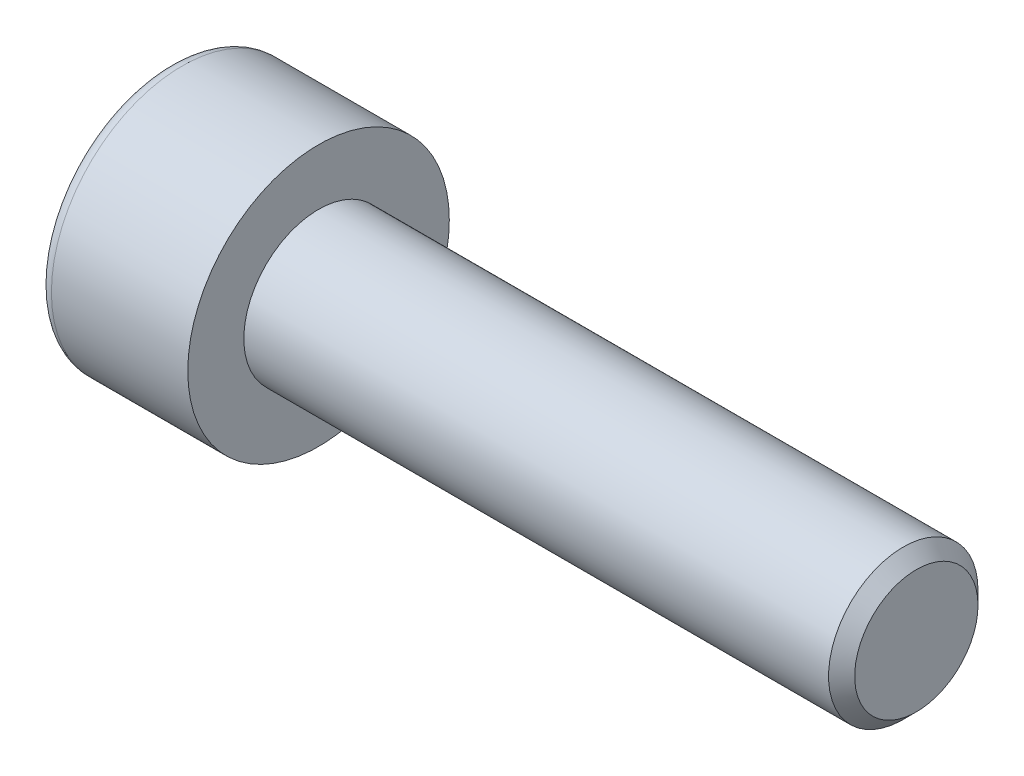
ISO-10303-21;
HEADER;
FILE_DESCRIPTION(('STEP AP214'),'2;1');
FILE_NAME('part.step','',(''),(''),'','','');
FILE_SCHEMA(('AUTOMOTIVE_DESIGN { 1 0 10303 214 1 1 1 1 }'));
ENDSEC;
DATA;
#1=APPLICATION_CONTEXT('core data for automotive mechanical design processes');
#2=APPLICATION_PROTOCOL_DEFINITION('international standard','automotive_design',2000,#1);
#3=PRODUCT_CONTEXT('',#1,'mechanical');
#4=PRODUCT('Part','Part','',(#3));
#5=PRODUCT_RELATED_PRODUCT_CATEGORY('part','',(#4));
#6=PRODUCT_DEFINITION_FORMATION('','',#4);
#7=PRODUCT_DEFINITION_CONTEXT('part definition',#1,'design');
#8=PRODUCT_DEFINITION('design','',#6,#7);
#9=PRODUCT_DEFINITION_SHAPE('','',#8);
#10=(LENGTH_UNIT() NAMED_UNIT(*) SI_UNIT(.MILLI.,.METRE.));
#11=(NAMED_UNIT(*) PLANE_ANGLE_UNIT() SI_UNIT($,.RADIAN.));
#12=(NAMED_UNIT(*) SI_UNIT($,.STERADIAN.) SOLID_ANGLE_UNIT());
#13=UNCERTAINTY_MEASURE_WITH_UNIT(LENGTH_MEASURE(1.E-05),#10,'distance_accuracy_value','');
#14=(GEOMETRIC_REPRESENTATION_CONTEXT(3) GLOBAL_UNCERTAINTY_ASSIGNED_CONTEXT((#13)) GLOBAL_UNIT_ASSIGNED_CONTEXT((#10,
#11,#12)) REPRESENTATION_CONTEXT('',''));
#15=CARTESIAN_POINT('',(0.,0.,0.));
#16=DIRECTION('',(0.,0.,1.));
#17=DIRECTION('',(1.,0.,0.));
#18=AXIS2_PLACEMENT_3D('',#15,#16,#17);
#19=CARTESIAN_POINT('',(12.5013072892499,0.,0.));
#20=DIRECTION('',(1.,0.,0.));
#21=DIRECTION('',(0.,0.,-1.));
#22=AXIS2_PLACEMENT_3D('',#19,#20,#21);
#23=CYLINDRICAL_SURFACE('',#22,2.);
#24=CARTESIAN_POINT('',(15.65,0.,0.));
#25=DIRECTION('',(1.,0.,0.));
#26=DIRECTION('',(0.,0.,-1.));
#27=AXIS2_PLACEMENT_3D('',#24,#25,#26);
#28=CIRCLE('',#27,2.);
#29=CARTESIAN_POINT('',(15.65,0.,-2.));
#30=VERTEX_POINT('',#29);
#31=EDGE_CURVE('E151',#30,#30,#28,.F.);
#32=ORIENTED_EDGE('',*,*,#31,.T.);
#33=EDGE_LOOP('',(#32));
#34=FACE_BOUND('',#33,.T.);
#35=CARTESIAN_POINT('',(0.,0.,0.));
#36=DIRECTION('',(1.,0.,0.));
#37=DIRECTION('',(0.,0.,-1.));
#38=AXIS2_PLACEMENT_3D('',#35,#36,#37);
#39=CIRCLE('',#38,2.);
#40=CARTESIAN_POINT('',(0.,0.,-2.));
#41=VERTEX_POINT('',#40);
#42=EDGE_CURVE('E137',#41,#41,#39,.T.);
#43=ORIENTED_EDGE('',*,*,#42,.T.);
#44=EDGE_LOOP('',(#43));
#45=FACE_BOUND('',#44,.T.);
#46=ADVANCED_FACE('F35',(#34,#45),#23,.T.);
#47=CARTESIAN_POINT('',(16.,2.,0.));
#48=DIRECTION('',(1.,0.,0.));
#49=DIRECTION('',(0.,0.,-1.));
#50=AXIS2_PLACEMENT_3D('',#47,#48,#49);
#51=PLANE('',#50);
#52=CARTESIAN_POINT('',(16.,0.,0.));
#53=DIRECTION('',(1.,0.,0.));
#54=DIRECTION('',(0.,0.,-1.));
#55=AXIS2_PLACEMENT_3D('',#52,#53,#54);
#56=CIRCLE('',#55,1.65);
#57=CARTESIAN_POINT('',(16.,0.,-1.65));
#58=VERTEX_POINT('',#57);
#59=EDGE_CURVE('E148',#58,#58,#56,.T.);
#60=ORIENTED_EDGE('',*,*,#59,.T.);
#61=EDGE_LOOP('',(#60));
#62=FACE_BOUND('',#61,.T.);
#63=ADVANCED_FACE('F173',(#62),#51,.T.);
#64=CARTESIAN_POINT('',(-4.00000000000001,3.49999999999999,0.));
#65=DIRECTION('',(-1.,0.,0.));
#66=DIRECTION('',(0.,0.,1.));
#67=AXIS2_PLACEMENT_3D('',#64,#65,#66);
#68=PLANE('',#67);
#69=DIRECTION('',(0.,0.866025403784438,0.5));
#70=VECTOR('',#69,1.);
#71=CARTESIAN_POINT('',(-4.00000000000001,-1.5,0.866025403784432));
#72=LINE('',#71,#70);
#73=CARTESIAN_POINT('',(-4.00000000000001,-1.5,0.866025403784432));
#74=VERTEX_POINT('',#73);
#75=CARTESIAN_POINT('',(-4.00000000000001,0.,1.73205080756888));
#76=VERTEX_POINT('',#75);
#77=EDGE_CURVE('E50',#74,#76,#72,.T.);
#78=ORIENTED_EDGE('',*,*,#77,.F.);
#79=DIRECTION('',(0.,0.,1.));
#80=VECTOR('',#79,1.);
#81=CARTESIAN_POINT('',(-4.00000000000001,-1.5,-0.866025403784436));
#82=LINE('',#81,#80);
#83=CARTESIAN_POINT('',(-4.00000000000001,-1.5,-0.866025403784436));
#84=VERTEX_POINT('',#83);
#85=EDGE_CURVE('E133',#84,#74,#82,.T.);
#86=ORIENTED_EDGE('',*,*,#85,.F.);
#87=DIRECTION('',(0.,-0.866025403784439,0.5));
#88=VECTOR('',#87,1.);
#89=CARTESIAN_POINT('',(-4.00000000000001,0.,-1.73205080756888));
#90=LINE('',#89,#88);
#91=CARTESIAN_POINT('',(-4.00000000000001,0.,-1.73205080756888));
#92=VERTEX_POINT('',#91);
#93=EDGE_CURVE('E131',#92,#84,#90,.T.);
#94=ORIENTED_EDGE('',*,*,#93,.F.);
#95=DIRECTION('',(0.,-0.866025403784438,-0.5));
#96=VECTOR('',#95,1.);
#97=CARTESIAN_POINT('',(-4.00000000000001,1.5,-0.866025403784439));
#98=LINE('',#97,#96);
#99=CARTESIAN_POINT('',(-4.00000000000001,1.5,-0.866025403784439));
#100=VERTEX_POINT('',#99);
#101=EDGE_CURVE('E98',#100,#92,#98,.T.);
#102=ORIENTED_EDGE('',*,*,#101,.F.);
#103=DIRECTION('',(0.,0.,-1.));
#104=VECTOR('',#103,1.);
#105=CARTESIAN_POINT('',(-4.,1.5,0.866025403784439));
#106=LINE('',#105,#104);
#107=CARTESIAN_POINT('',(-4.,1.5,0.866025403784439));
#108=VERTEX_POINT('',#107);
#109=EDGE_CURVE('E127',#108,#100,#106,.T.);
#110=ORIENTED_EDGE('',*,*,#109,.F.);
#111=DIRECTION('',(0.,0.866025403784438,-0.5));
#112=VECTOR('',#111,1.);
#113=CARTESIAN_POINT('',(-4.00000000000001,0.,1.73205080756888));
#114=LINE('',#113,#112);
#115=EDGE_CURVE('E124',#76,#108,#114,.T.);
#116=ORIENTED_EDGE('',*,*,#115,.F.);
#117=EDGE_LOOP('',(#78,#86,#94,#102,#110,#116));
#118=FACE_BOUND('',#117,.T.);
#119=CARTESIAN_POINT('',(-4.,0.,0.));
#120=DIRECTION('',(-1.,0.,0.));
#121=DIRECTION('',(0.,0.,1.));
#122=AXIS2_PLACEMENT_3D('',#119,#120,#121);
#123=CIRCLE('',#122,3.15);
#124=CARTESIAN_POINT('',(-4.,0.,3.15));
#125=VERTEX_POINT('',#124);
#126=EDGE_CURVE('E11',#125,#125,#123,.T.);
#127=ORIENTED_EDGE('',*,*,#126,.T.);
#128=EDGE_LOOP('',(#127));
#129=FACE_BOUND('',#128,.T.);
#130=ADVANCED_FACE('F179',(#118,#129),#68,.T.);
#131=CARTESIAN_POINT('',(12.5013072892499,0.,0.));
#132=DIRECTION('',(1.,0.,0.));
#133=DIRECTION('',(0.,0.,-1.));
#134=AXIS2_PLACEMENT_3D('',#131,#132,#133);
#135=CYLINDRICAL_SURFACE('',#134,3.5);
#136=CARTESIAN_POINT('',(-3.65000000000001,0.,0.));
#137=DIRECTION('',(-1.,0.,0.));
#138=DIRECTION('',(0.,0.,1.));
#139=AXIS2_PLACEMENT_3D('',#136,#137,#138);
#140=CIRCLE('',#139,3.5);
#141=CARTESIAN_POINT('',(-3.65000000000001,0.,3.5));
#142=VERTEX_POINT('',#141);
#143=EDGE_CURVE('E43',#142,#142,#140,.F.);
#144=ORIENTED_EDGE('',*,*,#143,.T.);
#145=EDGE_LOOP('',(#144));
#146=FACE_BOUND('',#145,.T.);
#147=CARTESIAN_POINT('',(0.,0.,0.));
#148=DIRECTION('',(1.,0.,0.));
#149=DIRECTION('',(0.,0.,-1.));
#150=AXIS2_PLACEMENT_3D('',#147,#148,#149);
#151=CIRCLE('',#150,3.5);
#152=CARTESIAN_POINT('',(0.,0.,-3.5));
#153=VERTEX_POINT('',#152);
#154=EDGE_CURVE('E145',#153,#153,#151,.T.);
#155=ORIENTED_EDGE('',*,*,#154,.F.);
#156=EDGE_LOOP('',(#155));
#157=FACE_BOUND('',#156,.T.);
#158=ADVANCED_FACE('F156',(#146,#157),#135,.T.);
#159=CARTESIAN_POINT('',(0.,2.,0.));
#160=DIRECTION('',(1.,0.,0.));
#161=DIRECTION('',(0.,0.,-1.));
#162=AXIS2_PLACEMENT_3D('',#159,#160,#161);
#163=PLANE('',#162);
#164=ORIENTED_EDGE('',*,*,#154,.T.);
#165=EDGE_LOOP('',(#164));
#166=FACE_BOUND('',#165,.T.);
#167=ORIENTED_EDGE('',*,*,#42,.F.);
#168=EDGE_LOOP('',(#167));
#169=FACE_BOUND('',#168,.T.);
#170=ADVANCED_FACE('F169',(#166,#169),#163,.T.);
#171=CARTESIAN_POINT('',(16.,0.,0.));
#172=DIRECTION('',(-1.,0.,0.));
#173=DIRECTION('',(0.,0.,1.));
#174=AXIS2_PLACEMENT_3D('',#171,#172,#173);
#175=CONICAL_SURFACE('',#174,1.65,0.785398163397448);
#176=ORIENTED_EDGE('',*,*,#31,.F.);
#177=EDGE_LOOP('',(#176));
#178=FACE_BOUND('',#177,.T.);
#179=ORIENTED_EDGE('',*,*,#59,.F.);
#180=EDGE_LOOP('',(#179));
#181=FACE_BOUND('',#180,.T.);
#182=ADVANCED_FACE('F161',(#178,#181),#175,.T.);
#183=CARTESIAN_POINT('',(-3.65000000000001,0.,0.));
#184=DIRECTION('',(-1.,0.,0.));
#185=DIRECTION('',(0.,0.,1.));
#186=AXIS2_PLACEMENT_3D('',#183,#184,#185);
#187=TOROIDAL_SURFACE('',#186,3.15,0.35);
#188=ORIENTED_EDGE('',*,*,#126,.F.);
#189=EDGE_LOOP('',(#188));
#190=FACE_BOUND('',#189,.T.);
#191=ORIENTED_EDGE('',*,*,#143,.F.);
#192=EDGE_LOOP('',(#191));
#193=FACE_BOUND('',#192,.T.);
#194=ADVANCED_FACE('F37',(#190,#193),#187,.T.);
#195=CARTESIAN_POINT('',(-1.60000000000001,-1.5,0.866025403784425));
#196=DIRECTION('',(0.,-0.5,0.866025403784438));
#197=DIRECTION('',(0.,-0.866025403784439,-0.5));
#198=AXIS2_PLACEMENT_3D('',#195,#196,#197);
#199=PLANE('',#198);
#200=ORIENTED_EDGE('',*,*,#77,.T.);
#201=DIRECTION('',(-1.,0.,0.));
#202=VECTOR('',#201,1.);
#203=CARTESIAN_POINT('',(-1.6,0.,1.73205080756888));
#204=LINE('',#203,#202);
#205=CARTESIAN_POINT('',(-1.6,0.,1.73205080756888));
#206=VERTEX_POINT('',#205);
#207=EDGE_CURVE('E80',#206,#76,#204,.T.);
#208=ORIENTED_EDGE('',*,*,#207,.F.);
#209=DIRECTION('',(0.,0.866025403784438,0.5));
#210=VECTOR('',#209,1.);
#211=CARTESIAN_POINT('',(-1.60000000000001,-1.5,0.866025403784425));
#212=LINE('',#211,#210);
#213=CARTESIAN_POINT('',(-1.60000000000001,-1.5,0.866025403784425));
#214=VERTEX_POINT('',#213);
#215=EDGE_CURVE('E135',#214,#206,#212,.T.);
#216=ORIENTED_EDGE('',*,*,#215,.F.);
#217=DIRECTION('',(-1.,0.,0.));
#218=VECTOR('',#217,1.);
#219=CARTESIAN_POINT('',(-1.60000000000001,-1.5,0.866025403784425));
#220=LINE('',#219,#218);
#221=EDGE_CURVE('E58',#214,#74,#220,.T.);
#222=ORIENTED_EDGE('',*,*,#221,.T.);
#223=EDGE_LOOP('',(#200,#208,#216,#222));
#224=FACE_BOUND('',#223,.T.);
#225=ADVANCED_FACE('F160',(#224),#199,.F.);
#226=CARTESIAN_POINT('',(-1.6,-1.5,-0.866025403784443));
#227=DIRECTION('',(0.,-1.,0.));
#228=DIRECTION('',(0.,0.,-1.));
#229=AXIS2_PLACEMENT_3D('',#226,#227,#228);
#230=PLANE('',#229);
#231=ORIENTED_EDGE('',*,*,#85,.T.);
#232=ORIENTED_EDGE('',*,*,#221,.F.);
#233=DIRECTION('',(0.,0.,1.));
#234=VECTOR('',#233,1.);
#235=CARTESIAN_POINT('',(-1.6,-1.5,-0.866025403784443));
#236=LINE('',#235,#234);
#237=CARTESIAN_POINT('',(-1.6,-1.5,-0.866025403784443));
#238=VERTEX_POINT('',#237);
#239=EDGE_CURVE('E110',#238,#214,#236,.T.);
#240=ORIENTED_EDGE('',*,*,#239,.F.);
#241=DIRECTION('',(-1.,0.,0.));
#242=VECTOR('',#241,1.);
#243=CARTESIAN_POINT('',(-1.6,-1.5,-0.866025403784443));
#244=LINE('',#243,#242);
#245=EDGE_CURVE('E102',#238,#84,#244,.T.);
#246=ORIENTED_EDGE('',*,*,#245,.T.);
#247=EDGE_LOOP('',(#231,#232,#240,#246));
#248=FACE_BOUND('',#247,.T.);
#249=ADVANCED_FACE('F167',(#248),#230,.F.);
#250=CARTESIAN_POINT('',(-1.60000000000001,0.,-1.73205080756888));
#251=DIRECTION('',(0.,-0.5,-0.866025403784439));
#252=DIRECTION('',(0.,0.866025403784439,-0.5));
#253=AXIS2_PLACEMENT_3D('',#250,#251,#252);
#254=PLANE('',#253);
#255=ORIENTED_EDGE('',*,*,#93,.T.);
#256=ORIENTED_EDGE('',*,*,#245,.F.);
#257=DIRECTION('',(0.,-0.866025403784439,0.5));
#258=VECTOR('',#257,1.);
#259=CARTESIAN_POINT('',(-1.60000000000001,0.,-1.73205080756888));
#260=LINE('',#259,#258);
#261=CARTESIAN_POINT('',(-1.60000000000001,0.,-1.73205080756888));
#262=VERTEX_POINT('',#261);
#263=EDGE_CURVE('E106',#262,#238,#260,.T.);
#264=ORIENTED_EDGE('',*,*,#263,.F.);
#265=DIRECTION('',(-1.,0.,0.));
#266=VECTOR('',#265,1.);
#267=CARTESIAN_POINT('',(-1.60000000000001,0.,-1.73205080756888));
#268=LINE('',#267,#266);
#269=EDGE_CURVE('E91',#262,#92,#268,.T.);
#270=ORIENTED_EDGE('',*,*,#269,.T.);
#271=EDGE_LOOP('',(#255,#256,#264,#270));
#272=FACE_BOUND('',#271,.T.);
#273=ADVANCED_FACE('F107',(#272),#254,.F.);
#274=CARTESIAN_POINT('',(-1.6,1.5,-0.866025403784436));
#275=DIRECTION('',(0.,0.5,-0.866025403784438));
#276=DIRECTION('',(0.,0.866025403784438,0.5));
#277=AXIS2_PLACEMENT_3D('',#274,#275,#276);
#278=PLANE('',#277);
#279=ORIENTED_EDGE('',*,*,#101,.T.);
#280=ORIENTED_EDGE('',*,*,#269,.F.);
#281=DIRECTION('',(0.,-0.866025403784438,-0.5));
#282=VECTOR('',#281,1.);
#283=CARTESIAN_POINT('',(-1.6,1.5,-0.866025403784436));
#284=LINE('',#283,#282);
#285=CARTESIAN_POINT('',(-1.6,1.5,-0.866025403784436));
#286=VERTEX_POINT('',#285);
#287=EDGE_CURVE('E95',#286,#262,#284,.T.);
#288=ORIENTED_EDGE('',*,*,#287,.F.);
#289=DIRECTION('',(-1.,0.,0.));
#290=VECTOR('',#289,1.);
#291=CARTESIAN_POINT('',(-1.6,1.5,-0.866025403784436));
#292=LINE('',#291,#290);
#293=EDGE_CURVE('E103',#286,#100,#292,.T.);
#294=ORIENTED_EDGE('',*,*,#293,.T.);
#295=EDGE_LOOP('',(#279,#280,#288,#294));
#296=FACE_BOUND('',#295,.T.);
#297=ADVANCED_FACE('F93',(#296),#278,.F.);
#298=CARTESIAN_POINT('',(-1.6,1.5,0.866025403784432));
#299=DIRECTION('',(0.,1.,0.));
#300=DIRECTION('',(0.,0.,1.));
#301=AXIS2_PLACEMENT_3D('',#298,#299,#300);
#302=PLANE('',#301);
#303=ORIENTED_EDGE('',*,*,#109,.T.);
#304=ORIENTED_EDGE('',*,*,#293,.F.);
#305=DIRECTION('',(0.,0.,-1.));
#306=VECTOR('',#305,1.);
#307=CARTESIAN_POINT('',(-1.6,1.5,0.866025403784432));
#308=LINE('',#307,#306);
#309=CARTESIAN_POINT('',(-1.6,1.5,0.866025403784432));
#310=VERTEX_POINT('',#309);
#311=EDGE_CURVE('E116',#310,#286,#308,.T.);
#312=ORIENTED_EDGE('',*,*,#311,.F.);
#313=DIRECTION('',(-1.,0.,0.));
#314=VECTOR('',#313,1.);
#315=CARTESIAN_POINT('',(-1.6,1.5,0.866025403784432));
#316=LINE('',#315,#314);
#317=EDGE_CURVE('E140',#310,#108,#316,.T.);
#318=ORIENTED_EDGE('',*,*,#317,.T.);
#319=EDGE_LOOP('',(#303,#304,#312,#318));
#320=FACE_BOUND('',#319,.T.);
#321=ADVANCED_FACE('F195',(#320),#302,.F.);
#322=CARTESIAN_POINT('',(-1.6,0.,1.73205080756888));
#323=DIRECTION('',(0.,0.5,0.866025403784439));
#324=DIRECTION('',(0.,-0.866025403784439,0.5));
#325=AXIS2_PLACEMENT_3D('',#322,#323,#324);
#326=PLANE('',#325);
#327=ORIENTED_EDGE('',*,*,#115,.T.);
#328=ORIENTED_EDGE('',*,*,#317,.F.);
#329=DIRECTION('',(0.,0.866025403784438,-0.5));
#330=VECTOR('',#329,1.);
#331=CARTESIAN_POINT('',(-1.6,0.,1.73205080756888));
#332=LINE('',#331,#330);
#333=EDGE_CURVE('E118',#206,#310,#332,.T.);
#334=ORIENTED_EDGE('',*,*,#333,.F.);
#335=ORIENTED_EDGE('',*,*,#207,.T.);
#336=EDGE_LOOP('',(#327,#328,#334,#335));
#337=FACE_BOUND('',#336,.T.);
#338=ADVANCED_FACE('F192',(#337),#326,.F.);
#339=CARTESIAN_POINT('',(-1.60000000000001,1.49999999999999,2.59807621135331));
#340=DIRECTION('',(-1.,0.,0.));
#341=DIRECTION('',(0.,0.,1.));
#342=AXIS2_PLACEMENT_3D('',#339,#340,#341);
#343=PLANE('',#342);
#344=ORIENTED_EDGE('',*,*,#215,.T.);
#345=ORIENTED_EDGE('',*,*,#333,.T.);
#346=ORIENTED_EDGE('',*,*,#311,.T.);
#347=ORIENTED_EDGE('',*,*,#287,.T.);
#348=ORIENTED_EDGE('',*,*,#263,.T.);
#349=ORIENTED_EDGE('',*,*,#239,.T.);
#350=EDGE_LOOP('',(#344,#345,#346,#347,#348,#349));
#351=FACE_BOUND('',#350,.T.);
#352=ADVANCED_FACE('F113',(#351),#343,.T.);
#353=CLOSED_SHELL('',(#46,#63,#130,#158,#170,#182,#194,#225,#249,#273,#297,#321,#338,#352));
#354=MANIFOLD_SOLID_BREP('B2',#353);
#355=ADVANCED_BREP_SHAPE_REPRESENTATION('',(#18,#354),#14);
#356=SHAPE_DEFINITION_REPRESENTATION(#9,#355);
ENDSEC;
END-ISO-10303-21;
